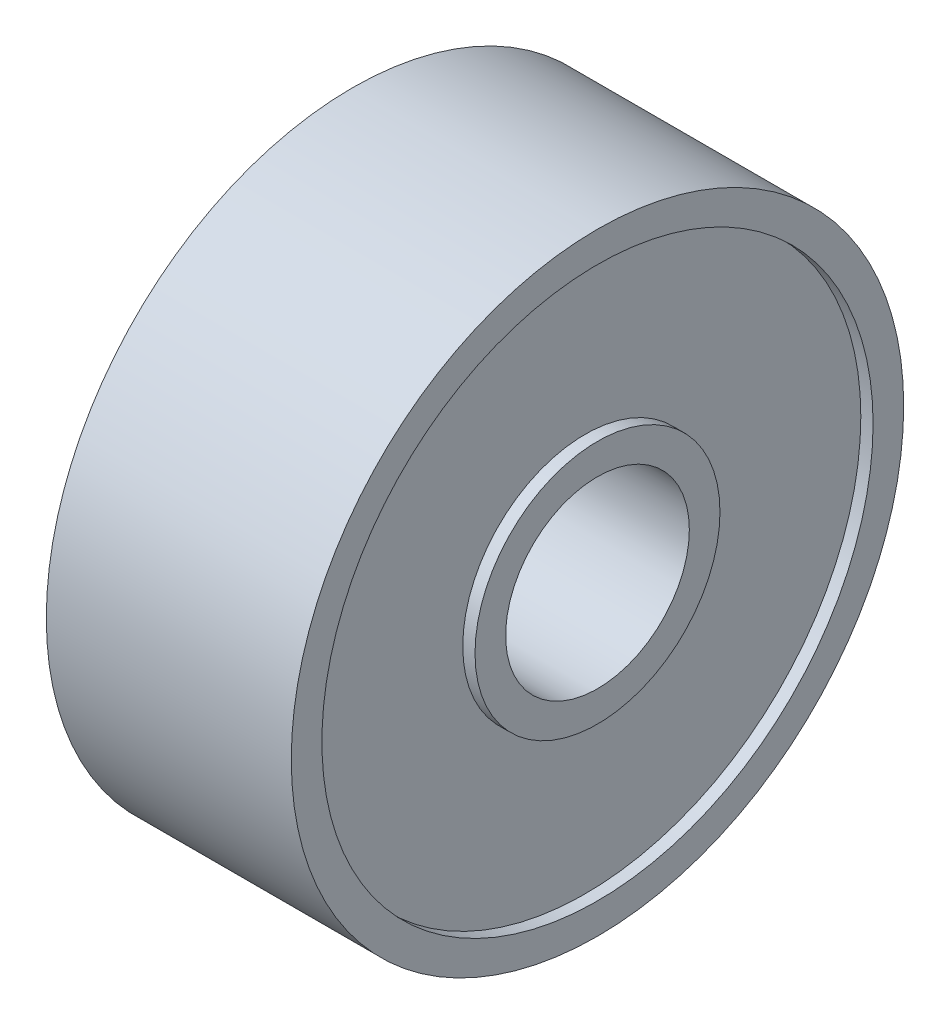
ISO-10303-21;
HEADER;
FILE_DESCRIPTION(('STEP AP214'),'2;1');
FILE_NAME('part.step','',(''),(''),'','','');
FILE_SCHEMA(('AUTOMOTIVE_DESIGN { 1 0 10303 214 1 1 1 1 }'));
ENDSEC;
DATA;
#1=APPLICATION_CONTEXT('core data for automotive mechanical design processes');
#2=APPLICATION_PROTOCOL_DEFINITION('international standard','automotive_design',2000,#1);
#3=PRODUCT_CONTEXT('',#1,'mechanical');
#4=PRODUCT('Part','Part','',(#3));
#5=PRODUCT_RELATED_PRODUCT_CATEGORY('part','',(#4));
#6=PRODUCT_DEFINITION_FORMATION('','',#4);
#7=PRODUCT_DEFINITION_CONTEXT('part definition',#1,'design');
#8=PRODUCT_DEFINITION('design','',#6,#7);
#9=PRODUCT_DEFINITION_SHAPE('','',#8);
#10=(LENGTH_UNIT() NAMED_UNIT(*) SI_UNIT(.MILLI.,.METRE.));
#11=(NAMED_UNIT(*) PLANE_ANGLE_UNIT() SI_UNIT($,.RADIAN.));
#12=(NAMED_UNIT(*) SI_UNIT($,.STERADIAN.) SOLID_ANGLE_UNIT());
#13=UNCERTAINTY_MEASURE_WITH_UNIT(LENGTH_MEASURE(1.E-05),#10,'distance_accuracy_value','');
#14=(GEOMETRIC_REPRESENTATION_CONTEXT(3) GLOBAL_UNCERTAINTY_ASSIGNED_CONTEXT((#13)) GLOBAL_UNIT_ASSIGNED_CONTEXT((#10,
#11,#12)) REPRESENTATION_CONTEXT('',''));
#15=CARTESIAN_POINT('',(0.,0.,0.));
#16=DIRECTION('',(0.,0.,1.));
#17=DIRECTION('',(1.,0.,0.));
#18=AXIS2_PLACEMENT_3D('',#15,#16,#17);
#19=CARTESIAN_POINT('',(0.,0.,0.));
#20=DIRECTION('',(1.,0.,0.));
#21=DIRECTION('',(0.,0.,-1.));
#22=AXIS2_PLACEMENT_3D('',#19,#20,#21);
#23=PLANE('',#22);
#24=CARTESIAN_POINT('',(0.,0.,0.));
#25=DIRECTION('',(1.,0.,0.));
#26=DIRECTION('',(0.,0.,-1.));
#27=AXIS2_PLACEMENT_3D('',#24,#25,#26);
#28=CIRCLE('',#27,1.5);
#29=CARTESIAN_POINT('',(0.,0.,-1.5));
#30=VERTEX_POINT('',#29);
#31=EDGE_CURVE('E50',#30,#30,#28,.T.);
#32=ORIENTED_EDGE('',*,*,#31,.T.);
#33=EDGE_LOOP('',(#32));
#34=FACE_BOUND('',#33,.T.);
#35=CARTESIAN_POINT('',(0.,0.,0.));
#36=DIRECTION('',(-1.,0.,0.));
#37=DIRECTION('',(0.,0.,1.));
#38=AXIS2_PLACEMENT_3D('',#35,#36,#37);
#39=CIRCLE('',#38,2.);
#40=CARTESIAN_POINT('',(0.,0.,2.));
#41=VERTEX_POINT('',#40);
#42=EDGE_CURVE('E74',#41,#41,#39,.T.);
#43=ORIENTED_EDGE('',*,*,#42,.T.);
#44=EDGE_LOOP('',(#43));
#45=FACE_BOUND('',#44,.T.);
#46=ADVANCED_FACE('F37',(#34,#45),#23,.F.);
#47=CARTESIAN_POINT('',(4.,0.,0.));
#48=DIRECTION('',(1.,0.,0.));
#49=DIRECTION('',(0.,0.,-1.));
#50=AXIS2_PLACEMENT_3D('',#47,#48,#49);
#51=PLANE('',#50);
#52=CARTESIAN_POINT('',(4.,0.,0.));
#53=DIRECTION('',(1.,0.,0.));
#54=DIRECTION('',(0.,0.,-1.));
#55=AXIS2_PLACEMENT_3D('',#52,#53,#54);
#56=CIRCLE('',#55,1.5);
#57=CARTESIAN_POINT('',(4.,0.,-1.5));
#58=VERTEX_POINT('',#57);
#59=EDGE_CURVE('E48',#58,#58,#56,.T.);
#60=ORIENTED_EDGE('',*,*,#59,.F.);
#61=EDGE_LOOP('',(#60));
#62=FACE_BOUND('',#61,.T.);
#63=CARTESIAN_POINT('',(4.,0.,0.));
#64=DIRECTION('',(1.,0.,0.));
#65=DIRECTION('',(0.,0.,-1.));
#66=AXIS2_PLACEMENT_3D('',#63,#64,#65);
#67=CIRCLE('',#66,2.);
#68=CARTESIAN_POINT('',(4.,0.,-2.));
#69=VERTEX_POINT('',#68);
#70=EDGE_CURVE('E62',#69,#69,#67,.T.);
#71=ORIENTED_EDGE('',*,*,#70,.T.);
#72=EDGE_LOOP('',(#71));
#73=FACE_BOUND('',#72,.T.);
#74=ADVANCED_FACE('F112',(#62,#73),#51,.T.);
#75=CARTESIAN_POINT('',(4.,0.,0.));
#76=DIRECTION('',(1.,0.,0.));
#77=DIRECTION('',(0.,0.,-1.));
#78=AXIS2_PLACEMENT_3D('',#75,#76,#77);
#79=CIRCLE('',#78,4.5);
#80=CARTESIAN_POINT('',(4.,0.,-4.5));
#81=VERTEX_POINT('',#80);
#82=EDGE_CURVE('E56',#81,#81,#79,.T.);
#83=ORIENTED_EDGE('',*,*,#82,.F.);
#84=EDGE_LOOP('',(#83));
#85=FACE_BOUND('',#84,.T.);
#86=CARTESIAN_POINT('',(4.,0.,0.));
#87=DIRECTION('',(1.,0.,0.));
#88=DIRECTION('',(0.,0.,-1.));
#89=AXIS2_PLACEMENT_3D('',#86,#87,#88);
#90=CIRCLE('',#89,5.);
#91=CARTESIAN_POINT('',(4.,0.,-5.));
#92=VERTEX_POINT('',#91);
#93=EDGE_CURVE('E10',#92,#92,#90,.T.);
#94=ORIENTED_EDGE('',*,*,#93,.T.);
#95=EDGE_LOOP('',(#94));
#96=FACE_BOUND('',#95,.T.);
#97=ADVANCED_FACE('F99',(#85,#96),#51,.T.);
#98=CARTESIAN_POINT('',(0.,0.,0.));
#99=DIRECTION('',(-1.,0.,0.));
#100=DIRECTION('',(0.,0.,1.));
#101=AXIS2_PLACEMENT_3D('',#98,#99,#100);
#102=CIRCLE('',#101,4.5);
#103=CARTESIAN_POINT('',(0.,0.,4.5));
#104=VERTEX_POINT('',#103);
#105=EDGE_CURVE('E68',#104,#104,#102,.T.);
#106=ORIENTED_EDGE('',*,*,#105,.F.);
#107=EDGE_LOOP('',(#106));
#108=FACE_BOUND('',#107,.T.);
#109=CARTESIAN_POINT('',(0.,0.,0.));
#110=DIRECTION('',(1.,0.,0.));
#111=DIRECTION('',(0.,0.,-1.));
#112=AXIS2_PLACEMENT_3D('',#109,#110,#111);
#113=CIRCLE('',#112,5.);
#114=CARTESIAN_POINT('',(0.,0.,-5.));
#115=VERTEX_POINT('',#114);
#116=EDGE_CURVE('E41',#115,#115,#113,.T.);
#117=ORIENTED_EDGE('',*,*,#116,.F.);
#118=EDGE_LOOP('',(#117));
#119=FACE_BOUND('',#118,.T.);
#120=ADVANCED_FACE('F96',(#108,#119),#23,.F.);
#121=CARTESIAN_POINT('',(4.,0.,0.));
#122=DIRECTION('',(-1.,0.,0.));
#123=DIRECTION('',(0.,0.,1.));
#124=AXIS2_PLACEMENT_3D('',#121,#122,#123);
#125=CYLINDRICAL_SURFACE('',#124,5.);
#126=ORIENTED_EDGE('',*,*,#93,.F.);
#127=EDGE_LOOP('',(#126));
#128=FACE_BOUND('',#127,.T.);
#129=ORIENTED_EDGE('',*,*,#116,.T.);
#130=EDGE_LOOP('',(#129));
#131=FACE_BOUND('',#130,.T.);
#132=ADVANCED_FACE('F39',(#128,#131),#125,.T.);
#133=CARTESIAN_POINT('',(4.,0.,0.));
#134=DIRECTION('',(-1.,0.,0.));
#135=DIRECTION('',(0.,0.,1.));
#136=AXIS2_PLACEMENT_3D('',#133,#134,#135);
#137=CYLINDRICAL_SURFACE('',#136,1.5);
#138=ORIENTED_EDGE('',*,*,#59,.T.);
#139=EDGE_LOOP('',(#138));
#140=FACE_BOUND('',#139,.T.);
#141=ORIENTED_EDGE('',*,*,#31,.F.);
#142=EDGE_LOOP('',(#141));
#143=FACE_BOUND('',#142,.T.);
#144=ADVANCED_FACE('F103',(#140,#143),#137,.F.);
#145=CARTESIAN_POINT('',(3.8,0.,0.));
#146=DIRECTION('',(1.,0.,0.));
#147=DIRECTION('',(0.,0.,-1.));
#148=AXIS2_PLACEMENT_3D('',#145,#146,#147);
#149=CYLINDRICAL_SURFACE('',#148,4.5);
#150=CARTESIAN_POINT('',(3.8,0.,0.));
#151=DIRECTION('',(1.,0.,0.));
#152=DIRECTION('',(0.,0.,-1.));
#153=AXIS2_PLACEMENT_3D('',#150,#151,#152);
#154=CIRCLE('',#153,4.5);
#155=CARTESIAN_POINT('',(3.8,0.,-4.5));
#156=VERTEX_POINT('',#155);
#157=EDGE_CURVE('E53',#156,#156,#154,.T.);
#158=ORIENTED_EDGE('',*,*,#157,.F.);
#159=EDGE_LOOP('',(#158));
#160=FACE_BOUND('',#159,.T.);
#161=ORIENTED_EDGE('',*,*,#82,.T.);
#162=EDGE_LOOP('',(#161));
#163=FACE_BOUND('',#162,.T.);
#164=ADVANCED_FACE('F108',(#160,#163),#149,.F.);
#165=CARTESIAN_POINT('',(3.8,0.,0.));
#166=DIRECTION('',(1.,0.,0.));
#167=DIRECTION('',(0.,0.,-1.));
#168=AXIS2_PLACEMENT_3D('',#165,#166,#167);
#169=PLANE('',#168);
#170=CARTESIAN_POINT('',(3.8,0.,0.));
#171=DIRECTION('',(1.,0.,0.));
#172=DIRECTION('',(0.,0.,-1.));
#173=AXIS2_PLACEMENT_3D('',#170,#171,#172);
#174=CIRCLE('',#173,2.);
#175=CARTESIAN_POINT('',(3.8,0.,-2.));
#176=VERTEX_POINT('',#175);
#177=EDGE_CURVE('E59',#176,#176,#174,.T.);
#178=ORIENTED_EDGE('',*,*,#177,.F.);
#179=EDGE_LOOP('',(#178));
#180=FACE_BOUND('',#179,.T.);
#181=ORIENTED_EDGE('',*,*,#157,.T.);
#182=EDGE_LOOP('',(#181));
#183=FACE_BOUND('',#182,.T.);
#184=ADVANCED_FACE('F125',(#180,#183),#169,.T.);
#185=CARTESIAN_POINT('',(3.8,0.,0.));
#186=DIRECTION('',(1.,0.,0.));
#187=DIRECTION('',(0.,0.,-1.));
#188=AXIS2_PLACEMENT_3D('',#185,#186,#187);
#189=CYLINDRICAL_SURFACE('',#188,2.);
#190=ORIENTED_EDGE('',*,*,#177,.T.);
#191=EDGE_LOOP('',(#190));
#192=FACE_BOUND('',#191,.T.);
#193=ORIENTED_EDGE('',*,*,#70,.F.);
#194=EDGE_LOOP('',(#193));
#195=FACE_BOUND('',#194,.T.);
#196=ADVANCED_FACE('F92',(#192,#195),#189,.T.);
#197=CARTESIAN_POINT('',(0.2,0.,0.));
#198=DIRECTION('',(-1.,0.,0.));
#199=DIRECTION('',(0.,0.,1.));
#200=AXIS2_PLACEMENT_3D('',#197,#198,#199);
#201=CYLINDRICAL_SURFACE('',#200,4.5);
#202=CARTESIAN_POINT('',(0.2,0.,0.));
#203=DIRECTION('',(-1.,0.,0.));
#204=DIRECTION('',(0.,0.,1.));
#205=AXIS2_PLACEMENT_3D('',#202,#203,#204);
#206=CIRCLE('',#205,4.5);
#207=CARTESIAN_POINT('',(0.2,0.,4.5));
#208=VERTEX_POINT('',#207);
#209=EDGE_CURVE('E65',#208,#208,#206,.T.);
#210=ORIENTED_EDGE('',*,*,#209,.F.);
#211=EDGE_LOOP('',(#210));
#212=FACE_BOUND('',#211,.T.);
#213=ORIENTED_EDGE('',*,*,#105,.T.);
#214=EDGE_LOOP('',(#213));
#215=FACE_BOUND('',#214,.T.);
#216=ADVANCED_FACE('F86',(#212,#215),#201,.F.);
#217=CARTESIAN_POINT('',(0.2,0.,0.));
#218=DIRECTION('',(-1.,0.,0.));
#219=DIRECTION('',(0.,0.,1.));
#220=AXIS2_PLACEMENT_3D('',#217,#218,#219);
#221=PLANE('',#220);
#222=CARTESIAN_POINT('',(0.2,0.,0.));
#223=DIRECTION('',(-1.,0.,0.));
#224=DIRECTION('',(0.,0.,1.));
#225=AXIS2_PLACEMENT_3D('',#222,#223,#224);
#226=CIRCLE('',#225,2.);
#227=CARTESIAN_POINT('',(0.2,0.,2.));
#228=VERTEX_POINT('',#227);
#229=EDGE_CURVE('E71',#228,#228,#226,.T.);
#230=ORIENTED_EDGE('',*,*,#229,.F.);
#231=EDGE_LOOP('',(#230));
#232=FACE_BOUND('',#231,.T.);
#233=ORIENTED_EDGE('',*,*,#209,.T.);
#234=EDGE_LOOP('',(#233));
#235=FACE_BOUND('',#234,.T.);
#236=ADVANCED_FACE('F83',(#232,#235),#221,.T.);
#237=CARTESIAN_POINT('',(0.2,0.,0.));
#238=DIRECTION('',(-1.,0.,0.));
#239=DIRECTION('',(0.,0.,1.));
#240=AXIS2_PLACEMENT_3D('',#237,#238,#239);
#241=CYLINDRICAL_SURFACE('',#240,2.);
#242=ORIENTED_EDGE('',*,*,#229,.T.);
#243=EDGE_LOOP('',(#242));
#244=FACE_BOUND('',#243,.T.);
#245=ORIENTED_EDGE('',*,*,#42,.F.);
#246=EDGE_LOOP('',(#245));
#247=FACE_BOUND('',#246,.T.);
#248=ADVANCED_FACE('F80',(#244,#247),#241,.T.);
#249=CLOSED_SHELL('',(#46,#74,#97,#120,#132,#144,#164,#184,#196,#216,#236,#248));
#250=MANIFOLD_SOLID_BREP('B2',#249);
#251=ADVANCED_BREP_SHAPE_REPRESENTATION('',(#18,#250),#14);
#252=SHAPE_DEFINITION_REPRESENTATION(#9,#251);
ENDSEC;
END-ISO-10303-21;
